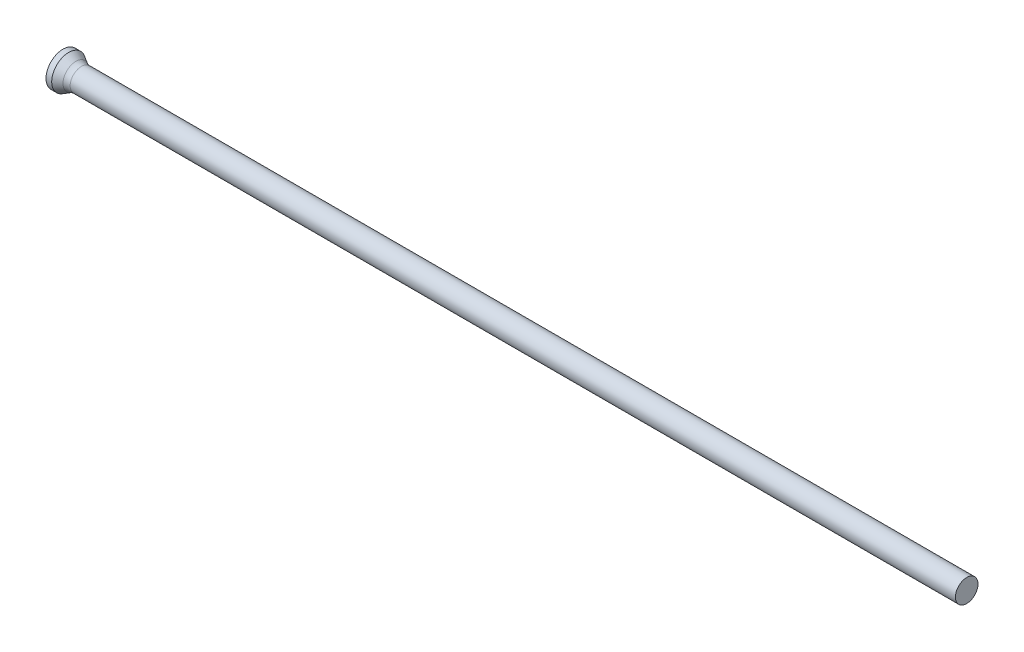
ISO-10303-21;
HEADER;
FILE_DESCRIPTION(('STEP AP214'),'2;1');
FILE_NAME('part.step','',(''),(''),'','','');
FILE_SCHEMA(('AUTOMOTIVE_DESIGN { 1 0 10303 214 1 1 1 1 }'));
ENDSEC;
DATA;
#1=APPLICATION_CONTEXT('core data for automotive mechanical design processes');
#2=APPLICATION_PROTOCOL_DEFINITION('international standard','automotive_design',2000,#1);
#3=PRODUCT_CONTEXT('',#1,'mechanical');
#4=PRODUCT('Part','Part','',(#3));
#5=PRODUCT_RELATED_PRODUCT_CATEGORY('part','',(#4));
#6=PRODUCT_DEFINITION_FORMATION('','',#4);
#7=PRODUCT_DEFINITION_CONTEXT('part definition',#1,'design');
#8=PRODUCT_DEFINITION('design','',#6,#7);
#9=PRODUCT_DEFINITION_SHAPE('','',#8);
#10=(LENGTH_UNIT() NAMED_UNIT(*) SI_UNIT(.MILLI.,.METRE.));
#11=(NAMED_UNIT(*) PLANE_ANGLE_UNIT() SI_UNIT($,.RADIAN.));
#12=(NAMED_UNIT(*) SI_UNIT($,.STERADIAN.) SOLID_ANGLE_UNIT());
#13=UNCERTAINTY_MEASURE_WITH_UNIT(LENGTH_MEASURE(1.E-05),#10,'distance_accuracy_value','');
#14=(GEOMETRIC_REPRESENTATION_CONTEXT(3) GLOBAL_UNCERTAINTY_ASSIGNED_CONTEXT((#13)) GLOBAL_UNIT_ASSIGNED_CONTEXT((#10,
#11,#12)) REPRESENTATION_CONTEXT('',''));
#15=CARTESIAN_POINT('',(0.,0.,0.));
#16=DIRECTION('',(0.,0.,1.));
#17=DIRECTION('',(1.,0.,0.));
#18=AXIS2_PLACEMENT_3D('',#15,#16,#17);
#19=CARTESIAN_POINT('',(0.,0.,0.));
#20=DIRECTION('',(1.,0.,0.));
#21=DIRECTION('',(0.,0.,-1.));
#22=AXIS2_PLACEMENT_3D('',#19,#20,#21);
#23=PLANE('',#22);
#24=CARTESIAN_POINT('',(0.,0.,0.));
#25=DIRECTION('',(-1.,0.,0.));
#26=DIRECTION('',(0.,0.,1.));
#27=AXIS2_PLACEMENT_3D('',#24,#25,#26);
#28=CIRCLE('',#27,1.5);
#29=CARTESIAN_POINT('',(0.,0.,1.5));
#30=VERTEX_POINT('',#29);
#31=EDGE_CURVE('E25',#30,#30,#28,.T.);
#32=ORIENTED_EDGE('',*,*,#31,.T.);
#33=EDGE_LOOP('',(#32));
#34=FACE_BOUND('',#33,.T.);
#35=ADVANCED_FACE('F14',(#34),#23,.F.);
#36=CARTESIAN_POINT('',(0.,0.,0.));
#37=DIRECTION('',(-1.,0.,0.));
#38=DIRECTION('',(0.,0.,1.));
#39=AXIS2_PLACEMENT_3D('',#36,#37,#38);
#40=CYLINDRICAL_SURFACE('',#39,1.5);
#41=ORIENTED_EDGE('',*,*,#31,.F.);
#42=EDGE_LOOP('',(#41));
#43=FACE_BOUND('',#42,.T.);
#44=CARTESIAN_POINT('',(0.503974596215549,0.,0.));
#45=DIRECTION('',(-1.,0.,0.));
#46=DIRECTION('',(0.,0.,1.));
#47=AXIS2_PLACEMENT_3D('',#44,#45,#46);
#48=CIRCLE('',#47,1.5);
#49=CARTESIAN_POINT('',(0.503974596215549,0.,1.5));
#50=VERTEX_POINT('',#49);
#51=EDGE_CURVE('E29',#50,#50,#48,.T.);
#52=ORIENTED_EDGE('',*,*,#51,.T.);
#53=EDGE_LOOP('',(#52));
#54=FACE_BOUND('',#53,.T.);
#55=ADVANCED_FACE('F53',(#43,#54),#40,.T.);
#56=CARTESIAN_POINT('',(1.37,0.,0.));
#57=DIRECTION('',(-1.,0.,0.));
#58=DIRECTION('',(0.,0.,1.));
#59=AXIS2_PLACEMENT_3D('',#56,#57,#58);
#60=CONICAL_SURFACE('',#59,1.,0.523598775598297);
#61=CARTESIAN_POINT('',(1.13794919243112,0.,0.));
#62=DIRECTION('',(-1.,0.,0.));
#63=DIRECTION('',(0.,0.,1.));
#64=AXIS2_PLACEMENT_3D('',#61,#62,#63);
#65=CIRCLE('',#64,1.13397459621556);
#66=CARTESIAN_POINT('',(1.13794919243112,0.,1.13397459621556));
#67=VERTEX_POINT('',#66);
#68=EDGE_CURVE('E21',#67,#67,#65,.T.);
#69=ORIENTED_EDGE('',*,*,#68,.T.);
#70=EDGE_LOOP('',(#69));
#71=FACE_BOUND('',#70,.T.);
#72=ORIENTED_EDGE('',*,*,#51,.F.);
#73=EDGE_LOOP('',(#72));
#74=FACE_BOUND('',#73,.T.);
#75=ADVANCED_FACE('F50',(#71,#74),#60,.T.);
#76=CARTESIAN_POINT('',(0.,0.,0.));
#77=DIRECTION('',(-1.,0.,0.));
#78=DIRECTION('',(0.,0.,1.));
#79=AXIS2_PLACEMENT_3D('',#76,#77,#78);
#80=CYLINDRICAL_SURFACE('',#79,1.);
#81=CARTESIAN_POINT('',(1.63794919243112,0.,0.));
#82=DIRECTION('',(-1.,0.,0.));
#83=DIRECTION('',(0.,0.,1.));
#84=AXIS2_PLACEMENT_3D('',#81,#82,#83);
#85=CIRCLE('',#84,1.);
#86=CARTESIAN_POINT('',(1.63794919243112,0.,1.));
#87=VERTEX_POINT('',#86);
#88=EDGE_CURVE('E9',#87,#87,#85,.F.);
#89=ORIENTED_EDGE('',*,*,#88,.T.);
#90=EDGE_LOOP('',(#89));
#91=FACE_BOUND('',#90,.T.);
#92=CARTESIAN_POINT('',(80.,0.,0.));
#93=DIRECTION('',(-1.,0.,0.));
#94=DIRECTION('',(0.,0.,1.));
#95=AXIS2_PLACEMENT_3D('',#92,#93,#94);
#96=CIRCLE('',#95,1.);
#97=CARTESIAN_POINT('',(80.,0.,1.));
#98=VERTEX_POINT('',#97);
#99=EDGE_CURVE('E34',#98,#98,#96,.T.);
#100=ORIENTED_EDGE('',*,*,#99,.T.);
#101=EDGE_LOOP('',(#100));
#102=FACE_BOUND('',#101,.T.);
#103=ADVANCED_FACE('F38',(#91,#102),#80,.T.);
#104=CARTESIAN_POINT('',(80.,1.,0.));
#105=DIRECTION('',(-1.,0.,0.));
#106=DIRECTION('',(0.,0.,1.));
#107=AXIS2_PLACEMENT_3D('',#104,#105,#106);
#108=PLANE('',#107);
#109=ORIENTED_EDGE('',*,*,#99,.F.);
#110=EDGE_LOOP('',(#109));
#111=FACE_BOUND('',#110,.T.);
#112=ADVANCED_FACE('F40',(#111),#108,.F.);
#113=CARTESIAN_POINT('',(1.63794919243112,0.,0.));
#114=DIRECTION('',(-1.,0.,0.));
#115=DIRECTION('',(0.,0.,1.));
#116=AXIS2_PLACEMENT_3D('',#113,#114,#115);
#117=TOROIDAL_SURFACE('',#116,2.,1.);
#118=ORIENTED_EDGE('',*,*,#88,.F.);
#119=EDGE_LOOP('',(#118));
#120=FACE_BOUND('',#119,.T.);
#121=ORIENTED_EDGE('',*,*,#68,.F.);
#122=EDGE_LOOP('',(#121));
#123=FACE_BOUND('',#122,.T.);
#124=ADVANCED_FACE('F16',(#120,#123),#117,.F.);
#125=CLOSED_SHELL('',(#35,#55,#75,#103,#112,#124));
#126=MANIFOLD_SOLID_BREP('B1',#125);
#127=ADVANCED_BREP_SHAPE_REPRESENTATION('',(#18,#126),#14);
#128=SHAPE_DEFINITION_REPRESENTATION(#9,#127);
ENDSEC;
END-ISO-10303-21;
